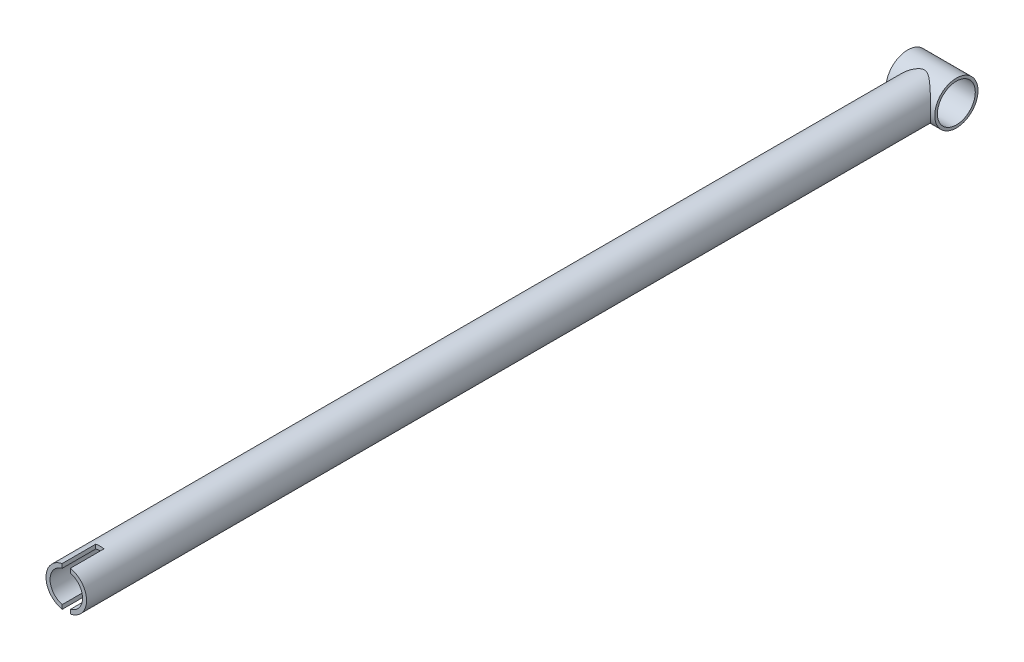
from build123d import *

# Parameters (mm, degrees)
SKETCH1_R           = 23.8125
SKETCH1_R_2         = 19.05
BASE_EXTRUDE_DEPTH  = 1016
SKETCH2_W           = 761.949004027
SKETCH2_H           = 9.652
CUT_EXTRUDE1_DEPTH  = 25.4
SKETCH4_R           = 25.4
SKETCH4_R_2         = 22.225
BOSS_EXTRUDE1_DEPTH = 28.575
SKETCH5_R           = 22.225
CUT_EXTRUDE2_DEPTH  = 31.75


with BuildPart() as part:
    # Sketch1 → Base-Extrude (new body)
    with BuildSketch(Plane.XY):
        Circle(SKETCH1_R)
        Circle(SKETCH1_R_2, mode=Mode.SUBTRACT)
    extrude(amount=BASE_EXTRUDE_DEPTH)

    # Sketch2 → Cut-Extrude1 (cut, symmetric)
    with BuildSketch(Plane(origin=(0, 0, 0), x_dir=(0, 0, -1), z_dir=(0, 1, 0))):
        with Locations((-1357.604502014, 0)):
            Rectangle(SKETCH2_W, SKETCH2_H)
    extrude(amount=CUT_EXTRUDE1_DEPTH, both=True, mode=Mode.SUBTRACT)

    # Sketch4 → Boss-Extrude1 (add, symmetric)
    with BuildSketch(Plane(origin=(0, 0, 0), x_dir=(0, -1, 0), z_dir=(1, 0, 0))):
        with Locations(Location((0, 0, 0), (0, 0, 90))):
            Circle(SKETCH4_R)
        with Locations(Location((0, 0, 0), (0, 0, 90))):
            Circle(SKETCH4_R_2, mode=Mode.SUBTRACT)
    extrude(amount=BOSS_EXTRUDE1_DEPTH, both=True)

    # Sketch5 → Cut-Extrude2 (cut, symmetric)
    with BuildSketch(Plane(origin=(0, 0, 0), x_dir=(0, 0, -1), z_dir=(1, 0, 0))):
        Circle(SKETCH5_R)
    extrude(amount=CUT_EXTRUDE2_DEPTH, both=True, mode=Mode.SUBTRACT)


solid = part.part
